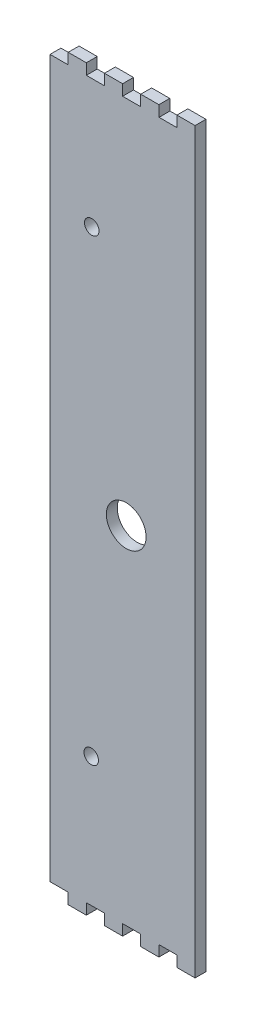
ISO-10303-21;
HEADER;
FILE_DESCRIPTION(('STEP AP214'),'2;1');
FILE_NAME('part.step','',(''),(''),'','','');
FILE_SCHEMA(('AUTOMOTIVE_DESIGN { 1 0 10303 214 1 1 1 1 }'));
ENDSEC;
DATA;
#1=APPLICATION_CONTEXT('core data for automotive mechanical design processes');
#2=APPLICATION_PROTOCOL_DEFINITION('international standard','automotive_design',2000,#1);
#3=PRODUCT_CONTEXT('',#1,'mechanical');
#4=PRODUCT('Part','Part','',(#3));
#5=PRODUCT_RELATED_PRODUCT_CATEGORY('part','',(#4));
#6=PRODUCT_DEFINITION_FORMATION('','',#4);
#7=PRODUCT_DEFINITION_CONTEXT('part definition',#1,'design');
#8=PRODUCT_DEFINITION('design','',#6,#7);
#9=PRODUCT_DEFINITION_SHAPE('','',#8);
#10=(LENGTH_UNIT() NAMED_UNIT(*) SI_UNIT(.MILLI.,.METRE.));
#11=(NAMED_UNIT(*) PLANE_ANGLE_UNIT() SI_UNIT($,.RADIAN.));
#12=(NAMED_UNIT(*) SI_UNIT($,.STERADIAN.) SOLID_ANGLE_UNIT());
#13=UNCERTAINTY_MEASURE_WITH_UNIT(LENGTH_MEASURE(1.E-05),#10,'distance_accuracy_value','');
#14=(GEOMETRIC_REPRESENTATION_CONTEXT(3) GLOBAL_UNCERTAINTY_ASSIGNED_CONTEXT((#13)) GLOBAL_UNIT_ASSIGNED_CONTEXT((#10,
#11,#12)) REPRESENTATION_CONTEXT('',''));
#15=CARTESIAN_POINT('',(0.,0.,0.));
#16=DIRECTION('',(0.,0.,1.));
#17=DIRECTION('',(1.,0.,0.));
#18=AXIS2_PLACEMENT_3D('',#15,#16,#17);
#19=CARTESIAN_POINT('',(-29.9999999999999,110.,6.));
#20=DIRECTION('',(0.,-1.,0.));
#21=DIRECTION('',(1.,0.,0.));
#22=AXIS2_PLACEMENT_3D('',#19,#20,#21);
#23=PLANE('',#22);
#24=DIRECTION('',(-1.,0.,0.));
#25=VECTOR('',#24,1.);
#26=CARTESIAN_POINT('',(-29.9999999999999,110.,0.));
#27=LINE('',#26,#25);
#28=CARTESIAN_POINT('',(-29.9999999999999,110.,0.));
#29=VERTEX_POINT('',#28);
#30=CARTESIAN_POINT('',(-39.9999999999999,110.,0.));
#31=VERTEX_POINT('',#30);
#32=EDGE_CURVE('E274',#29,#31,#27,.T.);
#33=ORIENTED_EDGE('',*,*,#32,.T.);
#34=DIRECTION('',(0.,0.,-1.));
#35=VECTOR('',#34,1.);
#36=CARTESIAN_POINT('',(-39.9999999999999,110.,6.));
#37=LINE('',#36,#35);
#38=CARTESIAN_POINT('',(-39.9999999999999,110.,6.));
#39=VERTEX_POINT('',#38);
#40=EDGE_CURVE('E11',#39,#31,#37,.T.);
#41=ORIENTED_EDGE('',*,*,#40,.F.);
#42=DIRECTION('',(-1.,0.,0.));
#43=VECTOR('',#42,1.);
#44=CARTESIAN_POINT('',(-29.9999999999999,110.,6.));
#45=LINE('',#44,#43);
#46=CARTESIAN_POINT('',(-29.9999999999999,110.,6.));
#47=VERTEX_POINT('',#46);
#48=EDGE_CURVE('E337',#47,#39,#45,.T.);
#49=ORIENTED_EDGE('',*,*,#48,.F.);
#50=DIRECTION('',(0.,0.,-1.));
#51=VECTOR('',#50,1.);
#52=CARTESIAN_POINT('',(-29.9999999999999,110.,6.));
#53=LINE('',#52,#51);
#54=EDGE_CURVE('E270',#47,#29,#53,.T.);
#55=ORIENTED_EDGE('',*,*,#54,.T.);
#56=EDGE_LOOP('',(#33,#41,#49,#55));
#57=FACE_BOUND('',#56,.T.);
#58=ADVANCED_FACE('F33',(#57),#23,.F.);
#59=CARTESIAN_POINT('',(-39.9999999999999,110.,6.));
#60=DIRECTION('',(1.,0.,0.));
#61=DIRECTION('',(0.,1.,0.));
#62=AXIS2_PLACEMENT_3D('',#59,#60,#61);
#63=PLANE('',#62);
#64=DIRECTION('',(0.,-1.,0.));
#65=VECTOR('',#64,1.);
#66=CARTESIAN_POINT('',(-39.9999999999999,110.,0.));
#67=LINE('',#66,#65);
#68=CARTESIAN_POINT('',(-39.9999999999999,-285.,0.));
#69=VERTEX_POINT('',#68);
#70=EDGE_CURVE('E277',#31,#69,#67,.T.);
#71=ORIENTED_EDGE('',*,*,#70,.T.);
#72=DIRECTION('',(0.,0.,-1.));
#73=VECTOR('',#72,1.);
#74=CARTESIAN_POINT('',(-39.9999999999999,-285.,6.));
#75=LINE('',#74,#73);
#76=CARTESIAN_POINT('',(-39.9999999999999,-285.,6.));
#77=VERTEX_POINT('',#76);
#78=EDGE_CURVE('E42',#77,#69,#75,.T.);
#79=ORIENTED_EDGE('',*,*,#78,.F.);
#80=DIRECTION('',(0.,-1.,0.));
#81=VECTOR('',#80,1.);
#82=CARTESIAN_POINT('',(-39.9999999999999,110.,6.));
#83=LINE('',#82,#81);
#84=EDGE_CURVE('E165',#39,#77,#83,.T.);
#85=ORIENTED_EDGE('',*,*,#84,.F.);
#86=ORIENTED_EDGE('',*,*,#40,.T.);
#87=EDGE_LOOP('',(#71,#79,#85,#86));
#88=FACE_BOUND('',#87,.T.);
#89=ADVANCED_FACE('F517',(#88),#63,.F.);
#90=CARTESIAN_POINT('',(-29.9999999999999,-285.,6.));
#91=DIRECTION('',(0.,1.,0.));
#92=DIRECTION('',(0.,0.,1.));
#93=AXIS2_PLACEMENT_3D('',#90,#91,#92);
#94=PLANE('',#93);
#95=DIRECTION('',(1.,0.,0.));
#96=VECTOR('',#95,1.);
#97=CARTESIAN_POINT('',(-29.9999999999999,-285.,0.));
#98=LINE('',#97,#96);
#99=CARTESIAN_POINT('',(-29.9999999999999,-285.,0.));
#100=VERTEX_POINT('',#99);
#101=EDGE_CURVE('E280',#69,#100,#98,.T.);
#102=ORIENTED_EDGE('',*,*,#101,.T.);
#103=DIRECTION('',(0.,0.,-1.));
#104=VECTOR('',#103,1.);
#105=CARTESIAN_POINT('',(-29.9999999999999,-285.,6.));
#106=LINE('',#105,#104);
#107=CARTESIAN_POINT('',(-29.9999999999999,-285.,6.));
#108=VERTEX_POINT('',#107);
#109=EDGE_CURVE('E416',#108,#100,#106,.T.);
#110=ORIENTED_EDGE('',*,*,#109,.F.);
#111=DIRECTION('',(1.,0.,0.));
#112=VECTOR('',#111,1.);
#113=CARTESIAN_POINT('',(-29.9999999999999,-285.,6.));
#114=LINE('',#113,#112);
#115=EDGE_CURVE('E425',#77,#108,#114,.T.);
#116=ORIENTED_EDGE('',*,*,#115,.F.);
#117=ORIENTED_EDGE('',*,*,#78,.T.);
#118=EDGE_LOOP('',(#102,#110,#116,#117));
#119=FACE_BOUND('',#118,.T.);
#120=ADVANCED_FACE('F423',(#119),#94,.F.);
#121=CARTESIAN_POINT('',(-29.9999999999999,-291.,6.));
#122=DIRECTION('',(1.,0.,0.));
#123=DIRECTION('',(0.,0.,-1.));
#124=AXIS2_PLACEMENT_3D('',#121,#122,#123);
#125=PLANE('',#124);
#126=DIRECTION('',(0.,-1.,0.));
#127=VECTOR('',#126,1.);
#128=CARTESIAN_POINT('',(-29.9999999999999,-291.,0.));
#129=LINE('',#128,#127);
#130=CARTESIAN_POINT('',(-29.9999999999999,-291.,0.));
#131=VERTEX_POINT('',#130);
#132=EDGE_CURVE('E282',#100,#131,#129,.T.);
#133=ORIENTED_EDGE('',*,*,#132,.T.);
#134=DIRECTION('',(0.,0.,-1.));
#135=VECTOR('',#134,1.);
#136=CARTESIAN_POINT('',(-29.9999999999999,-291.,6.));
#137=LINE('',#136,#135);
#138=CARTESIAN_POINT('',(-29.9999999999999,-291.,6.));
#139=VERTEX_POINT('',#138);
#140=EDGE_CURVE('E413',#139,#131,#137,.T.);
#141=ORIENTED_EDGE('',*,*,#140,.F.);
#142=DIRECTION('',(0.,-1.,0.));
#143=VECTOR('',#142,1.);
#144=CARTESIAN_POINT('',(-29.9999999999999,-291.,6.));
#145=LINE('',#144,#143);
#146=EDGE_CURVE('E443',#108,#139,#145,.T.);
#147=ORIENTED_EDGE('',*,*,#146,.F.);
#148=ORIENTED_EDGE('',*,*,#109,.T.);
#149=EDGE_LOOP('',(#133,#141,#147,#148));
#150=FACE_BOUND('',#149,.T.);
#151=ADVANCED_FACE('F434',(#150),#125,.F.);
#152=CARTESIAN_POINT('',(-19.9999999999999,-291.,6.));
#153=DIRECTION('',(0.,1.,0.));
#154=DIRECTION('',(0.,0.,1.));
#155=AXIS2_PLACEMENT_3D('',#152,#153,#154);
#156=PLANE('',#155);
#157=DIRECTION('',(1.,0.,0.));
#158=VECTOR('',#157,1.);
#159=CARTESIAN_POINT('',(-19.9999999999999,-291.,0.));
#160=LINE('',#159,#158);
#161=CARTESIAN_POINT('',(-19.9999999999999,-291.,0.));
#162=VERTEX_POINT('',#161);
#163=EDGE_CURVE('E284',#131,#162,#160,.T.);
#164=ORIENTED_EDGE('',*,*,#163,.T.);
#165=DIRECTION('',(0.,0.,-1.));
#166=VECTOR('',#165,1.);
#167=CARTESIAN_POINT('',(-19.9999999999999,-291.,6.));
#168=LINE('',#167,#166);
#169=CARTESIAN_POINT('',(-19.9999999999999,-291.,6.));
#170=VERTEX_POINT('',#169);
#171=EDGE_CURVE('E410',#170,#162,#168,.T.);
#172=ORIENTED_EDGE('',*,*,#171,.F.);
#173=DIRECTION('',(1.,0.,0.));
#174=VECTOR('',#173,1.);
#175=CARTESIAN_POINT('',(-19.9999999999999,-291.,6.));
#176=LINE('',#175,#174);
#177=EDGE_CURVE('E440',#139,#170,#176,.T.);
#178=ORIENTED_EDGE('',*,*,#177,.F.);
#179=ORIENTED_EDGE('',*,*,#140,.T.);
#180=EDGE_LOOP('',(#164,#172,#178,#179));
#181=FACE_BOUND('',#180,.T.);
#182=ADVANCED_FACE('F438',(#181),#156,.F.);
#183=CARTESIAN_POINT('',(-19.9999999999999,-291.,6.));
#184=DIRECTION('',(-1.,0.,0.));
#185=DIRECTION('',(0.,0.,1.));
#186=AXIS2_PLACEMENT_3D('',#183,#184,#185);
#187=PLANE('',#186);
#188=DIRECTION('',(0.,1.,0.));
#189=VECTOR('',#188,1.);
#190=CARTESIAN_POINT('',(-19.9999999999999,-291.,0.));
#191=LINE('',#190,#189);
#192=CARTESIAN_POINT('',(-19.9999999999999,-285.,0.));
#193=VERTEX_POINT('',#192);
#194=EDGE_CURVE('E286',#162,#193,#191,.T.);
#195=ORIENTED_EDGE('',*,*,#194,.T.);
#196=DIRECTION('',(0.,0.,-1.));
#197=VECTOR('',#196,1.);
#198=CARTESIAN_POINT('',(-19.9999999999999,-285.,6.));
#199=LINE('',#198,#197);
#200=CARTESIAN_POINT('',(-19.9999999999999,-285.,6.));
#201=VERTEX_POINT('',#200);
#202=EDGE_CURVE('E407',#201,#193,#199,.T.);
#203=ORIENTED_EDGE('',*,*,#202,.F.);
#204=DIRECTION('',(0.,1.,0.));
#205=VECTOR('',#204,1.);
#206=CARTESIAN_POINT('',(-19.9999999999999,-291.,6.));
#207=LINE('',#206,#205);
#208=EDGE_CURVE('E442',#170,#201,#207,.T.);
#209=ORIENTED_EDGE('',*,*,#208,.F.);
#210=ORIENTED_EDGE('',*,*,#171,.T.);
#211=EDGE_LOOP('',(#195,#203,#209,#210));
#212=FACE_BOUND('',#211,.T.);
#213=ADVANCED_FACE('F530',(#212),#187,.F.);
#214=CARTESIAN_POINT('',(-9.9999999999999,-285.,6.));
#215=DIRECTION('',(0.,1.,0.));
#216=DIRECTION('',(0.,0.,1.));
#217=AXIS2_PLACEMENT_3D('',#214,#215,#216);
#218=PLANE('',#217);
#219=DIRECTION('',(1.,0.,0.));
#220=VECTOR('',#219,1.);
#221=CARTESIAN_POINT('',(-9.9999999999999,-285.,0.));
#222=LINE('',#221,#220);
#223=CARTESIAN_POINT('',(-9.9999999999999,-285.,0.));
#224=VERTEX_POINT('',#223);
#225=EDGE_CURVE('E288',#193,#224,#222,.T.);
#226=ORIENTED_EDGE('',*,*,#225,.T.);
#227=DIRECTION('',(0.,0.,-1.));
#228=VECTOR('',#227,1.);
#229=CARTESIAN_POINT('',(-9.9999999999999,-285.,6.));
#230=LINE('',#229,#228);
#231=CARTESIAN_POINT('',(-9.9999999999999,-285.,6.));
#232=VERTEX_POINT('',#231);
#233=EDGE_CURVE('E404',#232,#224,#230,.T.);
#234=ORIENTED_EDGE('',*,*,#233,.F.);
#235=DIRECTION('',(1.,0.,0.));
#236=VECTOR('',#235,1.);
#237=CARTESIAN_POINT('',(-9.9999999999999,-285.,6.));
#238=LINE('',#237,#236);
#239=EDGE_CURVE('E445',#201,#232,#238,.T.);
#240=ORIENTED_EDGE('',*,*,#239,.F.);
#241=ORIENTED_EDGE('',*,*,#202,.T.);
#242=EDGE_LOOP('',(#226,#234,#240,#241));
#243=FACE_BOUND('',#242,.T.);
#244=ADVANCED_FACE('F533',(#243),#218,.F.);
#245=CARTESIAN_POINT('',(-9.9999999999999,-291.,6.));
#246=DIRECTION('',(1.,0.,0.));
#247=DIRECTION('',(0.,0.,-1.));
#248=AXIS2_PLACEMENT_3D('',#245,#246,#247);
#249=PLANE('',#248);
#250=DIRECTION('',(0.,-1.,0.));
#251=VECTOR('',#250,1.);
#252=CARTESIAN_POINT('',(-9.9999999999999,-291.,0.));
#253=LINE('',#252,#251);
#254=CARTESIAN_POINT('',(-9.9999999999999,-291.,0.));
#255=VERTEX_POINT('',#254);
#256=EDGE_CURVE('E290',#224,#255,#253,.T.);
#257=ORIENTED_EDGE('',*,*,#256,.T.);
#258=DIRECTION('',(0.,0.,-1.));
#259=VECTOR('',#258,1.);
#260=CARTESIAN_POINT('',(-9.9999999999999,-291.,6.));
#261=LINE('',#260,#259);
#262=CARTESIAN_POINT('',(-9.9999999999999,-291.,6.));
#263=VERTEX_POINT('',#262);
#264=EDGE_CURVE('E401',#263,#255,#261,.T.);
#265=ORIENTED_EDGE('',*,*,#264,.F.);
#266=DIRECTION('',(0.,-1.,0.));
#267=VECTOR('',#266,1.);
#268=CARTESIAN_POINT('',(-9.9999999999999,-291.,6.));
#269=LINE('',#268,#267);
#270=EDGE_CURVE('E451',#232,#263,#269,.T.);
#271=ORIENTED_EDGE('',*,*,#270,.F.);
#272=ORIENTED_EDGE('',*,*,#233,.T.);
#273=EDGE_LOOP('',(#257,#265,#271,#272));
#274=FACE_BOUND('',#273,.T.);
#275=ADVANCED_FACE('F537',(#274),#249,.F.);
#276=CARTESIAN_POINT('',(1.04083408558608E-13,-291.,6.));
#277=DIRECTION('',(0.,1.,0.));
#278=DIRECTION('',(0.,0.,1.));
#279=AXIS2_PLACEMENT_3D('',#276,#277,#278);
#280=PLANE('',#279);
#281=DIRECTION('',(1.,0.,0.));
#282=VECTOR('',#281,1.);
#283=CARTESIAN_POINT('',(1.04083408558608E-13,-291.,0.));
#284=LINE('',#283,#282);
#285=CARTESIAN_POINT('',(1.04083408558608E-13,-291.,0.));
#286=VERTEX_POINT('',#285);
#287=EDGE_CURVE('E292',#255,#286,#284,.T.);
#288=ORIENTED_EDGE('',*,*,#287,.T.);
#289=DIRECTION('',(0.,0.,-1.));
#290=VECTOR('',#289,1.);
#291=CARTESIAN_POINT('',(1.04083408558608E-13,-291.,6.));
#292=LINE('',#291,#290);
#293=CARTESIAN_POINT('',(1.04083408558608E-13,-291.,6.));
#294=VERTEX_POINT('',#293);
#295=EDGE_CURVE('E398',#294,#286,#292,.T.);
#296=ORIENTED_EDGE('',*,*,#295,.F.);
#297=DIRECTION('',(1.,0.,0.));
#298=VECTOR('',#297,1.);
#299=CARTESIAN_POINT('',(1.04083408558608E-13,-291.,6.));
#300=LINE('',#299,#298);
#301=EDGE_CURVE('E453',#263,#294,#300,.T.);
#302=ORIENTED_EDGE('',*,*,#301,.F.);
#303=ORIENTED_EDGE('',*,*,#264,.T.);
#304=EDGE_LOOP('',(#288,#296,#302,#303));
#305=FACE_BOUND('',#304,.T.);
#306=ADVANCED_FACE('F541',(#305),#280,.F.);
#307=CARTESIAN_POINT('',(1.04083408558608E-13,-291.,6.));
#308=DIRECTION('',(-1.,0.,0.));
#309=DIRECTION('',(0.,0.,1.));
#310=AXIS2_PLACEMENT_3D('',#307,#308,#309);
#311=PLANE('',#310);
#312=DIRECTION('',(0.,1.,0.));
#313=VECTOR('',#312,1.);
#314=CARTESIAN_POINT('',(1.04083408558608E-13,-291.,0.));
#315=LINE('',#314,#313);
#316=CARTESIAN_POINT('',(1.04083408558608E-13,-285.,0.));
#317=VERTEX_POINT('',#316);
#318=EDGE_CURVE('E294',#286,#317,#315,.T.);
#319=ORIENTED_EDGE('',*,*,#318,.T.);
#320=DIRECTION('',(0.,0.,-1.));
#321=VECTOR('',#320,1.);
#322=CARTESIAN_POINT('',(1.04083408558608E-13,-285.,6.));
#323=LINE('',#322,#321);
#324=CARTESIAN_POINT('',(1.04083408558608E-13,-285.,6.));
#325=VERTEX_POINT('',#324);
#326=EDGE_CURVE('E395',#325,#317,#323,.T.);
#327=ORIENTED_EDGE('',*,*,#326,.F.);
#328=DIRECTION('',(0.,1.,0.));
#329=VECTOR('',#328,1.);
#330=CARTESIAN_POINT('',(1.04083408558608E-13,-291.,6.));
#331=LINE('',#330,#329);
#332=EDGE_CURVE('E455',#294,#325,#331,.T.);
#333=ORIENTED_EDGE('',*,*,#332,.F.);
#334=ORIENTED_EDGE('',*,*,#295,.T.);
#335=EDGE_LOOP('',(#319,#327,#333,#334));
#336=FACE_BOUND('',#335,.T.);
#337=ADVANCED_FACE('F545',(#336),#311,.F.);
#338=CARTESIAN_POINT('',(10.0000000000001,-285.,6.));
#339=DIRECTION('',(0.,1.,0.));
#340=DIRECTION('',(0.,0.,1.));
#341=AXIS2_PLACEMENT_3D('',#338,#339,#340);
#342=PLANE('',#341);
#343=DIRECTION('',(1.,0.,0.));
#344=VECTOR('',#343,1.);
#345=CARTESIAN_POINT('',(10.0000000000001,-285.,0.));
#346=LINE('',#345,#344);
#347=CARTESIAN_POINT('',(10.0000000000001,-285.,0.));
#348=VERTEX_POINT('',#347);
#349=EDGE_CURVE('E296',#317,#348,#346,.T.);
#350=ORIENTED_EDGE('',*,*,#349,.T.);
#351=DIRECTION('',(0.,0.,-1.));
#352=VECTOR('',#351,1.);
#353=CARTESIAN_POINT('',(10.0000000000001,-285.,6.));
#354=LINE('',#353,#352);
#355=CARTESIAN_POINT('',(10.0000000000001,-285.,6.));
#356=VERTEX_POINT('',#355);
#357=EDGE_CURVE('E392',#356,#348,#354,.T.);
#358=ORIENTED_EDGE('',*,*,#357,.F.);
#359=DIRECTION('',(1.,0.,0.));
#360=VECTOR('',#359,1.);
#361=CARTESIAN_POINT('',(10.0000000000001,-285.,6.));
#362=LINE('',#361,#360);
#363=EDGE_CURVE('E457',#325,#356,#362,.T.);
#364=ORIENTED_EDGE('',*,*,#363,.F.);
#365=ORIENTED_EDGE('',*,*,#326,.T.);
#366=EDGE_LOOP('',(#350,#358,#364,#365));
#367=FACE_BOUND('',#366,.T.);
#368=ADVANCED_FACE('F549',(#367),#342,.F.);
#369=CARTESIAN_POINT('',(10.0000000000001,-291.,6.));
#370=DIRECTION('',(1.,0.,0.));
#371=DIRECTION('',(0.,0.,-1.));
#372=AXIS2_PLACEMENT_3D('',#369,#370,#371);
#373=PLANE('',#372);
#374=DIRECTION('',(0.,-1.,0.));
#375=VECTOR('',#374,1.);
#376=CARTESIAN_POINT('',(10.0000000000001,-291.,0.));
#377=LINE('',#376,#375);
#378=CARTESIAN_POINT('',(10.0000000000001,-291.,0.));
#379=VERTEX_POINT('',#378);
#380=EDGE_CURVE('E298',#348,#379,#377,.T.);
#381=ORIENTED_EDGE('',*,*,#380,.T.);
#382=DIRECTION('',(0.,0.,-1.));
#383=VECTOR('',#382,1.);
#384=CARTESIAN_POINT('',(10.0000000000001,-291.,6.));
#385=LINE('',#384,#383);
#386=CARTESIAN_POINT('',(10.0000000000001,-291.,6.));
#387=VERTEX_POINT('',#386);
#388=EDGE_CURVE('E389',#387,#379,#385,.T.);
#389=ORIENTED_EDGE('',*,*,#388,.F.);
#390=DIRECTION('',(0.,-1.,0.));
#391=VECTOR('',#390,1.);
#392=CARTESIAN_POINT('',(10.0000000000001,-291.,6.));
#393=LINE('',#392,#391);
#394=EDGE_CURVE('E459',#356,#387,#393,.T.);
#395=ORIENTED_EDGE('',*,*,#394,.F.);
#396=ORIENTED_EDGE('',*,*,#357,.T.);
#397=EDGE_LOOP('',(#381,#389,#395,#396));
#398=FACE_BOUND('',#397,.T.);
#399=ADVANCED_FACE('F553',(#398),#373,.F.);
#400=CARTESIAN_POINT('',(20.0000000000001,-291.,6.));
#401=DIRECTION('',(0.,1.,0.));
#402=DIRECTION('',(0.,0.,1.));
#403=AXIS2_PLACEMENT_3D('',#400,#401,#402);
#404=PLANE('',#403);
#405=DIRECTION('',(1.,0.,0.));
#406=VECTOR('',#405,1.);
#407=CARTESIAN_POINT('',(20.0000000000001,-291.,0.));
#408=LINE('',#407,#406);
#409=CARTESIAN_POINT('',(20.0000000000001,-291.,0.));
#410=VERTEX_POINT('',#409);
#411=EDGE_CURVE('E300',#379,#410,#408,.T.);
#412=ORIENTED_EDGE('',*,*,#411,.T.);
#413=DIRECTION('',(0.,0.,-1.));
#414=VECTOR('',#413,1.);
#415=CARTESIAN_POINT('',(20.0000000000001,-291.,6.));
#416=LINE('',#415,#414);
#417=CARTESIAN_POINT('',(20.0000000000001,-291.,6.));
#418=VERTEX_POINT('',#417);
#419=EDGE_CURVE('E386',#418,#410,#416,.T.);
#420=ORIENTED_EDGE('',*,*,#419,.F.);
#421=DIRECTION('',(1.,0.,0.));
#422=VECTOR('',#421,1.);
#423=CARTESIAN_POINT('',(20.0000000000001,-291.,6.));
#424=LINE('',#423,#422);
#425=EDGE_CURVE('E461',#387,#418,#424,.T.);
#426=ORIENTED_EDGE('',*,*,#425,.F.);
#427=ORIENTED_EDGE('',*,*,#388,.T.);
#428=EDGE_LOOP('',(#412,#420,#426,#427));
#429=FACE_BOUND('',#428,.T.);
#430=ADVANCED_FACE('F557',(#429),#404,.F.);
#431=CARTESIAN_POINT('',(20.0000000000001,-291.,6.));
#432=DIRECTION('',(-1.,0.,0.));
#433=DIRECTION('',(0.,-1.,0.));
#434=AXIS2_PLACEMENT_3D('',#431,#432,#433);
#435=PLANE('',#434);
#436=DIRECTION('',(0.,1.,0.));
#437=VECTOR('',#436,1.);
#438=CARTESIAN_POINT('',(20.0000000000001,-291.,0.));
#439=LINE('',#438,#437);
#440=CARTESIAN_POINT('',(20.0000000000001,-285.,0.));
#441=VERTEX_POINT('',#440);
#442=EDGE_CURVE('E302',#410,#441,#439,.T.);
#443=ORIENTED_EDGE('',*,*,#442,.T.);
#444=DIRECTION('',(0.,0.,-1.));
#445=VECTOR('',#444,1.);
#446=CARTESIAN_POINT('',(20.0000000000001,-285.,6.));
#447=LINE('',#446,#445);
#448=CARTESIAN_POINT('',(20.0000000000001,-285.,6.));
#449=VERTEX_POINT('',#448);
#450=EDGE_CURVE('E383',#449,#441,#447,.T.);
#451=ORIENTED_EDGE('',*,*,#450,.F.);
#452=DIRECTION('',(0.,1.,0.));
#453=VECTOR('',#452,1.);
#454=CARTESIAN_POINT('',(20.0000000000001,-291.,6.));
#455=LINE('',#454,#453);
#456=EDGE_CURVE('E463',#418,#449,#455,.T.);
#457=ORIENTED_EDGE('',*,*,#456,.F.);
#458=ORIENTED_EDGE('',*,*,#419,.T.);
#459=EDGE_LOOP('',(#443,#451,#457,#458));
#460=FACE_BOUND('',#459,.T.);
#461=ADVANCED_FACE('F561',(#460),#435,.F.);
#462=CARTESIAN_POINT('',(30.0000000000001,-285.,6.));
#463=DIRECTION('',(0.,1.,0.));
#464=DIRECTION('',(0.,0.,1.));
#465=AXIS2_PLACEMENT_3D('',#462,#463,#464);
#466=PLANE('',#465);
#467=DIRECTION('',(1.,0.,0.));
#468=VECTOR('',#467,1.);
#469=CARTESIAN_POINT('',(30.0000000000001,-285.,0.));
#470=LINE('',#469,#468);
#471=CARTESIAN_POINT('',(30.0000000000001,-285.,0.));
#472=VERTEX_POINT('',#471);
#473=EDGE_CURVE('E304',#441,#472,#470,.T.);
#474=ORIENTED_EDGE('',*,*,#473,.T.);
#475=DIRECTION('',(0.,0.,-1.));
#476=VECTOR('',#475,1.);
#477=CARTESIAN_POINT('',(30.0000000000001,-285.,6.));
#478=LINE('',#477,#476);
#479=CARTESIAN_POINT('',(30.0000000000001,-285.,6.));
#480=VERTEX_POINT('',#479);
#481=EDGE_CURVE('E380',#480,#472,#478,.T.);
#482=ORIENTED_EDGE('',*,*,#481,.F.);
#483=DIRECTION('',(1.,0.,0.));
#484=VECTOR('',#483,1.);
#485=CARTESIAN_POINT('',(30.0000000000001,-285.,6.));
#486=LINE('',#485,#484);
#487=EDGE_CURVE('E465',#449,#480,#486,.T.);
#488=ORIENTED_EDGE('',*,*,#487,.F.);
#489=ORIENTED_EDGE('',*,*,#450,.T.);
#490=EDGE_LOOP('',(#474,#482,#488,#489));
#491=FACE_BOUND('',#490,.T.);
#492=ADVANCED_FACE('F565',(#491),#466,.F.);
#493=CARTESIAN_POINT('',(29.95,-291.,6.));
#494=DIRECTION('',(0.999965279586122,-0.00833304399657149,0.));
#495=DIRECTION('',(0.00833304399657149,0.999965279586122,0.));
#496=AXIS2_PLACEMENT_3D('',#493,#494,#495);
#497=PLANE('',#496);
#498=DIRECTION('',(-0.00833304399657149,-0.999965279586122,0.));
#499=VECTOR('',#498,1.);
#500=CARTESIAN_POINT('',(29.95,-291.,0.));
#501=LINE('',#500,#499);
#502=CARTESIAN_POINT('',(29.95,-291.,0.));
#503=VERTEX_POINT('',#502);
#504=EDGE_CURVE('E306',#472,#503,#501,.T.);
#505=ORIENTED_EDGE('',*,*,#504,.T.);
#506=DIRECTION('',(0.,0.,-1.));
#507=VECTOR('',#506,1.);
#508=CARTESIAN_POINT('',(29.95,-291.,6.));
#509=LINE('',#508,#507);
#510=CARTESIAN_POINT('',(29.95,-291.,6.));
#511=VERTEX_POINT('',#510);
#512=EDGE_CURVE('E377',#511,#503,#509,.T.);
#513=ORIENTED_EDGE('',*,*,#512,.F.);
#514=DIRECTION('',(-0.00833304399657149,-0.999965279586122,0.));
#515=VECTOR('',#514,1.);
#516=CARTESIAN_POINT('',(29.95,-291.,6.));
#517=LINE('',#516,#515);
#518=EDGE_CURVE('E467',#480,#511,#517,.T.);
#519=ORIENTED_EDGE('',*,*,#518,.F.);
#520=ORIENTED_EDGE('',*,*,#481,.T.);
#521=EDGE_LOOP('',(#505,#513,#519,#520));
#522=FACE_BOUND('',#521,.T.);
#523=ADVANCED_FACE('F569',(#522),#497,.F.);
#524=CARTESIAN_POINT('',(39.95,-291.,6.));
#525=DIRECTION('',(0.,1.,0.));
#526=DIRECTION('',(0.,0.,1.));
#527=AXIS2_PLACEMENT_3D('',#524,#525,#526);
#528=PLANE('',#527);
#529=DIRECTION('',(1.,0.,0.));
#530=VECTOR('',#529,1.);
#531=CARTESIAN_POINT('',(39.95,-291.,0.));
#532=LINE('',#531,#530);
#533=CARTESIAN_POINT('',(39.95,-291.,0.));
#534=VERTEX_POINT('',#533);
#535=EDGE_CURVE('E308',#503,#534,#532,.T.);
#536=ORIENTED_EDGE('',*,*,#535,.T.);
#537=DIRECTION('',(0.,0.,-1.));
#538=VECTOR('',#537,1.);
#539=CARTESIAN_POINT('',(39.95,-291.,6.));
#540=LINE('',#539,#538);
#541=CARTESIAN_POINT('',(39.95,-291.,6.));
#542=VERTEX_POINT('',#541);
#543=EDGE_CURVE('E374',#542,#534,#540,.T.);
#544=ORIENTED_EDGE('',*,*,#543,.F.);
#545=DIRECTION('',(1.,0.,0.));
#546=VECTOR('',#545,1.);
#547=CARTESIAN_POINT('',(39.95,-291.,6.));
#548=LINE('',#547,#546);
#549=EDGE_CURVE('E469',#511,#542,#548,.T.);
#550=ORIENTED_EDGE('',*,*,#549,.F.);
#551=ORIENTED_EDGE('',*,*,#512,.T.);
#552=EDGE_LOOP('',(#536,#544,#550,#551));
#553=FACE_BOUND('',#552,.T.);
#554=ADVANCED_FACE('F573',(#553),#528,.F.);
#555=CARTESIAN_POINT('',(39.95,116.,6.));
#556=DIRECTION('',(-1.,0.,0.));
#557=DIRECTION('',(0.,0.,1.));
#558=AXIS2_PLACEMENT_3D('',#555,#556,#557);
#559=PLANE('',#558);
#560=DIRECTION('',(0.,1.,0.));
#561=VECTOR('',#560,1.);
#562=CARTESIAN_POINT('',(39.95,116.,0.));
#563=LINE('',#562,#561);
#564=CARTESIAN_POINT('',(39.95,116.,0.));
#565=VERTEX_POINT('',#564);
#566=EDGE_CURVE('E310',#534,#565,#563,.T.);
#567=ORIENTED_EDGE('',*,*,#566,.T.);
#568=DIRECTION('',(0.,0.,-1.));
#569=VECTOR('',#568,1.);
#570=CARTESIAN_POINT('',(39.95,116.,6.));
#571=LINE('',#570,#569);
#572=CARTESIAN_POINT('',(39.95,116.,6.));
#573=VERTEX_POINT('',#572);
#574=EDGE_CURVE('E371',#573,#565,#571,.T.);
#575=ORIENTED_EDGE('',*,*,#574,.F.);
#576=DIRECTION('',(0.,1.,0.));
#577=VECTOR('',#576,1.);
#578=CARTESIAN_POINT('',(39.95,116.,6.));
#579=LINE('',#578,#577);
#580=EDGE_CURVE('E471',#542,#573,#579,.T.);
#581=ORIENTED_EDGE('',*,*,#580,.F.);
#582=ORIENTED_EDGE('',*,*,#543,.T.);
#583=EDGE_LOOP('',(#567,#575,#581,#582));
#584=FACE_BOUND('',#583,.T.);
#585=ADVANCED_FACE('F577',(#584),#559,.F.);
#586=CARTESIAN_POINT('',(39.95,116.,6.));
#587=DIRECTION('',(0.,-1.,0.));
#588=DIRECTION('',(0.,0.,-1.));
#589=AXIS2_PLACEMENT_3D('',#586,#587,#588);
#590=PLANE('',#589);
#591=DIRECTION('',(-1.,0.,0.));
#592=VECTOR('',#591,1.);
#593=CARTESIAN_POINT('',(39.95,116.,0.));
#594=LINE('',#593,#592);
#595=CARTESIAN_POINT('',(29.95,116.,0.));
#596=VERTEX_POINT('',#595);
#597=EDGE_CURVE('E312',#565,#596,#594,.T.);
#598=ORIENTED_EDGE('',*,*,#597,.T.);
#599=DIRECTION('',(0.,0.,-1.));
#600=VECTOR('',#599,1.);
#601=CARTESIAN_POINT('',(29.95,116.,6.));
#602=LINE('',#601,#600);
#603=CARTESIAN_POINT('',(29.95,116.,6.));
#604=VERTEX_POINT('',#603);
#605=EDGE_CURVE('E368',#604,#596,#602,.T.);
#606=ORIENTED_EDGE('',*,*,#605,.F.);
#607=DIRECTION('',(-1.,0.,0.));
#608=VECTOR('',#607,1.);
#609=CARTESIAN_POINT('',(39.95,116.,6.));
#610=LINE('',#609,#608);
#611=EDGE_CURVE('E473',#573,#604,#610,.T.);
#612=ORIENTED_EDGE('',*,*,#611,.F.);
#613=ORIENTED_EDGE('',*,*,#574,.T.);
#614=EDGE_LOOP('',(#598,#606,#612,#613));
#615=FACE_BOUND('',#614,.T.);
#616=ADVANCED_FACE('F581',(#615),#590,.F.);
#617=CARTESIAN_POINT('',(29.95,116.,6.));
#618=DIRECTION('',(0.999687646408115,0.0249921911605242,0.));
#619=DIRECTION('',(-0.0249921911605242,0.999687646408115,0.));
#620=AXIS2_PLACEMENT_3D('',#617,#618,#619);
#621=PLANE('',#620);
#622=DIRECTION('',(0.0249921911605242,-0.999687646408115,0.));
#623=VECTOR('',#622,1.);
#624=CARTESIAN_POINT('',(29.95,116.,0.));
#625=LINE('',#624,#623);
#626=CARTESIAN_POINT('',(30.1000000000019,110.,0.));
#627=VERTEX_POINT('',#626);
#628=EDGE_CURVE('E314',#596,#627,#625,.T.);
#629=ORIENTED_EDGE('',*,*,#628,.T.);
#630=DIRECTION('',(0.,0.,-1.));
#631=VECTOR('',#630,1.);
#632=CARTESIAN_POINT('',(30.1000000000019,110.,6.));
#633=LINE('',#632,#631);
#634=CARTESIAN_POINT('',(30.1000000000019,110.,6.));
#635=VERTEX_POINT('',#634);
#636=EDGE_CURVE('E365',#635,#627,#633,.T.);
#637=ORIENTED_EDGE('',*,*,#636,.F.);
#638=DIRECTION('',(0.0249921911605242,-0.999687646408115,0.));
#639=VECTOR('',#638,1.);
#640=CARTESIAN_POINT('',(29.95,116.,6.));
#641=LINE('',#640,#639);
#642=EDGE_CURVE('E475',#604,#635,#641,.T.);
#643=ORIENTED_EDGE('',*,*,#642,.F.);
#644=ORIENTED_EDGE('',*,*,#605,.T.);
#645=EDGE_LOOP('',(#629,#637,#643,#644));
#646=FACE_BOUND('',#645,.T.);
#647=ADVANCED_FACE('F585',(#646),#621,.F.);
#648=CARTESIAN_POINT('',(30.1000000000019,110.,6.));
#649=DIRECTION('',(0.,-1.,0.));
#650=DIRECTION('',(1.,0.,0.));
#651=AXIS2_PLACEMENT_3D('',#648,#649,#650);
#652=PLANE('',#651);
#653=DIRECTION('',(-1.,0.,0.));
#654=VECTOR('',#653,1.);
#655=CARTESIAN_POINT('',(30.1000000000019,110.,0.));
#656=LINE('',#655,#654);
#657=CARTESIAN_POINT('',(20.1000000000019,110.,0.));
#658=VERTEX_POINT('',#657);
#659=EDGE_CURVE('E316',#627,#658,#656,.T.);
#660=ORIENTED_EDGE('',*,*,#659,.T.);
#661=DIRECTION('',(0.,0.,-1.));
#662=VECTOR('',#661,1.);
#663=CARTESIAN_POINT('',(20.1000000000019,110.,6.));
#664=LINE('',#663,#662);
#665=CARTESIAN_POINT('',(20.1000000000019,110.,6.));
#666=VERTEX_POINT('',#665);
#667=EDGE_CURVE('E362',#666,#658,#664,.T.);
#668=ORIENTED_EDGE('',*,*,#667,.F.);
#669=DIRECTION('',(-1.,0.,0.));
#670=VECTOR('',#669,1.);
#671=CARTESIAN_POINT('',(30.1000000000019,110.,6.));
#672=LINE('',#671,#670);
#673=EDGE_CURVE('E477',#635,#666,#672,.T.);
#674=ORIENTED_EDGE('',*,*,#673,.F.);
#675=ORIENTED_EDGE('',*,*,#636,.T.);
#676=EDGE_LOOP('',(#660,#668,#674,#675));
#677=FACE_BOUND('',#676,.T.);
#678=ADVANCED_FACE('F589',(#677),#652,.F.);
#679=CARTESIAN_POINT('',(20.,116.,6.));
#680=DIRECTION('',(-0.999861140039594,-0.0166643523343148,0.));
#681=DIRECTION('',(0.0166643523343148,-0.999861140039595,0.));
#682=AXIS2_PLACEMENT_3D('',#679,#680,#681);
#683=PLANE('',#682);
#684=DIRECTION('',(-0.0166643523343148,0.999861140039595,0.));
#685=VECTOR('',#684,1.);
#686=CARTESIAN_POINT('',(20.,116.,0.));
#687=LINE('',#686,#685);
#688=CARTESIAN_POINT('',(20.,116.,0.));
#689=VERTEX_POINT('',#688);
#690=EDGE_CURVE('E318',#658,#689,#687,.T.);
#691=ORIENTED_EDGE('',*,*,#690,.T.);
#692=DIRECTION('',(0.,0.,-1.));
#693=VECTOR('',#692,1.);
#694=CARTESIAN_POINT('',(20.,116.,6.));
#695=LINE('',#694,#693);
#696=CARTESIAN_POINT('',(20.,116.,6.));
#697=VERTEX_POINT('',#696);
#698=EDGE_CURVE('E359',#697,#689,#695,.T.);
#699=ORIENTED_EDGE('',*,*,#698,.F.);
#700=DIRECTION('',(-0.0166643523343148,0.999861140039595,0.));
#701=VECTOR('',#700,1.);
#702=CARTESIAN_POINT('',(20.,116.,6.));
#703=LINE('',#702,#701);
#704=EDGE_CURVE('E479',#666,#697,#703,.T.);
#705=ORIENTED_EDGE('',*,*,#704,.F.);
#706=ORIENTED_EDGE('',*,*,#667,.T.);
#707=EDGE_LOOP('',(#691,#699,#705,#706));
#708=FACE_BOUND('',#707,.T.);
#709=ADVANCED_FACE('F593',(#708),#683,.F.);
#710=CARTESIAN_POINT('',(20.,116.,6.));
#711=DIRECTION('',(0.,-1.,0.));
#712=DIRECTION('',(0.,0.,-1.));
#713=AXIS2_PLACEMENT_3D('',#710,#711,#712);
#714=PLANE('',#713);
#715=DIRECTION('',(-1.,0.,0.));
#716=VECTOR('',#715,1.);
#717=CARTESIAN_POINT('',(20.,116.,0.));
#718=LINE('',#717,#716);
#719=CARTESIAN_POINT('',(9.99999999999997,116.,0.));
#720=VERTEX_POINT('',#719);
#721=EDGE_CURVE('E320',#689,#720,#718,.T.);
#722=ORIENTED_EDGE('',*,*,#721,.T.);
#723=DIRECTION('',(0.,0.,-1.));
#724=VECTOR('',#723,1.);
#725=CARTESIAN_POINT('',(9.99999999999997,116.,6.));
#726=LINE('',#725,#724);
#727=CARTESIAN_POINT('',(9.99999999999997,116.,6.));
#728=VERTEX_POINT('',#727);
#729=EDGE_CURVE('E356',#728,#720,#726,.T.);
#730=ORIENTED_EDGE('',*,*,#729,.F.);
#731=DIRECTION('',(-1.,0.,0.));
#732=VECTOR('',#731,1.);
#733=CARTESIAN_POINT('',(20.,116.,6.));
#734=LINE('',#733,#732);
#735=EDGE_CURVE('E481',#697,#728,#734,.T.);
#736=ORIENTED_EDGE('',*,*,#735,.F.);
#737=ORIENTED_EDGE('',*,*,#698,.T.);
#738=EDGE_LOOP('',(#722,#730,#736,#737));
#739=FACE_BOUND('',#738,.T.);
#740=ADVANCED_FACE('F597',(#739),#714,.F.);
#741=CARTESIAN_POINT('',(9.99999999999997,116.,6.));
#742=DIRECTION('',(1.,0.,0.));
#743=DIRECTION('',(0.,0.,-1.));
#744=AXIS2_PLACEMENT_3D('',#741,#742,#743);
#745=PLANE('',#744);
#746=DIRECTION('',(0.,-1.,0.));
#747=VECTOR('',#746,1.);
#748=CARTESIAN_POINT('',(9.99999999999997,116.,0.));
#749=LINE('',#748,#747);
#750=CARTESIAN_POINT('',(9.99999999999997,110.,0.));
#751=VERTEX_POINT('',#750);
#752=EDGE_CURVE('E322',#720,#751,#749,.T.);
#753=ORIENTED_EDGE('',*,*,#752,.T.);
#754=DIRECTION('',(0.,0.,-1.));
#755=VECTOR('',#754,1.);
#756=CARTESIAN_POINT('',(9.99999999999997,110.,6.));
#757=LINE('',#756,#755);
#758=CARTESIAN_POINT('',(9.99999999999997,110.,6.));
#759=VERTEX_POINT('',#758);
#760=EDGE_CURVE('E353',#759,#751,#757,.T.);
#761=ORIENTED_EDGE('',*,*,#760,.F.);
#762=DIRECTION('',(0.,-1.,0.));
#763=VECTOR('',#762,1.);
#764=CARTESIAN_POINT('',(9.99999999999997,116.,6.));
#765=LINE('',#764,#763);
#766=EDGE_CURVE('E483',#728,#759,#765,.T.);
#767=ORIENTED_EDGE('',*,*,#766,.F.);
#768=ORIENTED_EDGE('',*,*,#729,.T.);
#769=EDGE_LOOP('',(#753,#761,#767,#768));
#770=FACE_BOUND('',#769,.T.);
#771=ADVANCED_FACE('F601',(#770),#745,.F.);
#772=CARTESIAN_POINT('',(9.99999999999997,110.,6.));
#773=DIRECTION('',(0.,-1.,0.));
#774=DIRECTION('',(1.,0.,0.));
#775=AXIS2_PLACEMENT_3D('',#772,#773,#774);
#776=PLANE('',#775);
#777=DIRECTION('',(-1.,0.,0.));
#778=VECTOR('',#777,1.);
#779=CARTESIAN_POINT('',(9.99999999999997,110.,0.));
#780=LINE('',#779,#778);
#781=CARTESIAN_POINT('',(0.,110.,0.));
#782=VERTEX_POINT('',#781);
#783=EDGE_CURVE('E324',#751,#782,#780,.T.);
#784=ORIENTED_EDGE('',*,*,#783,.T.);
#785=DIRECTION('',(0.,0.,-1.));
#786=VECTOR('',#785,1.);
#787=CARTESIAN_POINT('',(0.,110.,6.));
#788=LINE('',#787,#786);
#789=CARTESIAN_POINT('',(0.,110.,6.));
#790=VERTEX_POINT('',#789);
#791=EDGE_CURVE('E350',#790,#782,#788,.T.);
#792=ORIENTED_EDGE('',*,*,#791,.F.);
#793=DIRECTION('',(-1.,0.,0.));
#794=VECTOR('',#793,1.);
#795=CARTESIAN_POINT('',(9.99999999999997,110.,6.));
#796=LINE('',#795,#794);
#797=EDGE_CURVE('E485',#759,#790,#796,.T.);
#798=ORIENTED_EDGE('',*,*,#797,.F.);
#799=ORIENTED_EDGE('',*,*,#760,.T.);
#800=EDGE_LOOP('',(#784,#792,#798,#799));
#801=FACE_BOUND('',#800,.T.);
#802=ADVANCED_FACE('F605',(#801),#776,.F.);
#803=CARTESIAN_POINT('',(0.,116.,6.));
#804=DIRECTION('',(-1.,0.,0.));
#805=DIRECTION('',(0.,-1.,0.));
#806=AXIS2_PLACEMENT_3D('',#803,#804,#805);
#807=PLANE('',#806);
#808=DIRECTION('',(0.,1.,0.));
#809=VECTOR('',#808,1.);
#810=CARTESIAN_POINT('',(0.,116.,0.));
#811=LINE('',#810,#809);
#812=CARTESIAN_POINT('',(0.,116.,0.));
#813=VERTEX_POINT('',#812);
#814=EDGE_CURVE('E326',#782,#813,#811,.T.);
#815=ORIENTED_EDGE('',*,*,#814,.T.);
#816=DIRECTION('',(0.,0.,-1.));
#817=VECTOR('',#816,1.);
#818=CARTESIAN_POINT('',(0.,116.,6.));
#819=LINE('',#818,#817);
#820=CARTESIAN_POINT('',(0.,116.,6.));
#821=VERTEX_POINT('',#820);
#822=EDGE_CURVE('E347',#821,#813,#819,.T.);
#823=ORIENTED_EDGE('',*,*,#822,.F.);
#824=DIRECTION('',(0.,1.,0.));
#825=VECTOR('',#824,1.);
#826=CARTESIAN_POINT('',(0.,116.,6.));
#827=LINE('',#826,#825);
#828=EDGE_CURVE('E487',#790,#821,#827,.T.);
#829=ORIENTED_EDGE('',*,*,#828,.F.);
#830=ORIENTED_EDGE('',*,*,#791,.T.);
#831=EDGE_LOOP('',(#815,#823,#829,#830));
#832=FACE_BOUND('',#831,.T.);
#833=ADVANCED_FACE('F609',(#832),#807,.F.);
#834=CARTESIAN_POINT('',(0.,116.,6.));
#835=DIRECTION('',(0.,-1.,0.));
#836=DIRECTION('',(0.,0.,-1.));
#837=AXIS2_PLACEMENT_3D('',#834,#835,#836);
#838=PLANE('',#837);
#839=DIRECTION('',(-1.,0.,0.));
#840=VECTOR('',#839,1.);
#841=CARTESIAN_POINT('',(0.,116.,0.));
#842=LINE('',#841,#840);
#843=CARTESIAN_POINT('',(-10.,116.,0.));
#844=VERTEX_POINT('',#843);
#845=EDGE_CURVE('E328',#813,#844,#842,.T.);
#846=ORIENTED_EDGE('',*,*,#845,.T.);
#847=DIRECTION('',(0.,0.,-1.));
#848=VECTOR('',#847,1.);
#849=CARTESIAN_POINT('',(-10.,116.,6.));
#850=LINE('',#849,#848);
#851=CARTESIAN_POINT('',(-10.,116.,6.));
#852=VERTEX_POINT('',#851);
#853=EDGE_CURVE('E344',#852,#844,#850,.T.);
#854=ORIENTED_EDGE('',*,*,#853,.F.);
#855=DIRECTION('',(-1.,0.,0.));
#856=VECTOR('',#855,1.);
#857=CARTESIAN_POINT('',(0.,116.,6.));
#858=LINE('',#857,#856);
#859=EDGE_CURVE('E489',#821,#852,#858,.T.);
#860=ORIENTED_EDGE('',*,*,#859,.F.);
#861=ORIENTED_EDGE('',*,*,#822,.T.);
#862=EDGE_LOOP('',(#846,#854,#860,#861));
#863=FACE_BOUND('',#862,.T.);
#864=ADVANCED_FACE('F613',(#863),#838,.F.);
#865=CARTESIAN_POINT('',(-10.,116.,6.));
#866=DIRECTION('',(1.,0.,0.));
#867=DIRECTION('',(0.,0.,-1.));
#868=AXIS2_PLACEMENT_3D('',#865,#866,#867);
#869=PLANE('',#868);
#870=DIRECTION('',(0.,-1.,0.));
#871=VECTOR('',#870,1.);
#872=CARTESIAN_POINT('',(-10.,116.,0.));
#873=LINE('',#872,#871);
#874=CARTESIAN_POINT('',(-10.,110.,0.));
#875=VERTEX_POINT('',#874);
#876=EDGE_CURVE('E330',#844,#875,#873,.T.);
#877=ORIENTED_EDGE('',*,*,#876,.T.);
#878=DIRECTION('',(0.,0.,-1.));
#879=VECTOR('',#878,1.);
#880=CARTESIAN_POINT('',(-10.,110.,6.));
#881=LINE('',#880,#879);
#882=CARTESIAN_POINT('',(-10.,110.,6.));
#883=VERTEX_POINT('',#882);
#884=EDGE_CURVE('E341',#883,#875,#881,.T.);
#885=ORIENTED_EDGE('',*,*,#884,.F.);
#886=DIRECTION('',(0.,-1.,0.));
#887=VECTOR('',#886,1.);
#888=CARTESIAN_POINT('',(-10.,116.,6.));
#889=LINE('',#888,#887);
#890=EDGE_CURVE('E491',#852,#883,#889,.T.);
#891=ORIENTED_EDGE('',*,*,#890,.F.);
#892=ORIENTED_EDGE('',*,*,#853,.T.);
#893=EDGE_LOOP('',(#877,#885,#891,#892));
#894=FACE_BOUND('',#893,.T.);
#895=ADVANCED_FACE('F497',(#894),#869,.F.);
#896=CARTESIAN_POINT('',(-10.,110.,6.));
#897=DIRECTION('',(0.,-1.,0.));
#898=DIRECTION('',(0.,0.,-1.));
#899=AXIS2_PLACEMENT_3D('',#896,#897,#898);
#900=PLANE('',#899);
#901=DIRECTION('',(-1.,0.,0.));
#902=VECTOR('',#901,1.);
#903=CARTESIAN_POINT('',(-10.,110.,0.));
#904=LINE('',#903,#902);
#905=CARTESIAN_POINT('',(-20.,110.,0.));
#906=VERTEX_POINT('',#905);
#907=EDGE_CURVE('E332',#875,#906,#904,.T.);
#908=ORIENTED_EDGE('',*,*,#907,.T.);
#909=DIRECTION('',(0.,0.,-1.));
#910=VECTOR('',#909,1.);
#911=CARTESIAN_POINT('',(-20.,110.,6.));
#912=LINE('',#911,#910);
#913=CARTESIAN_POINT('',(-20.,110.,6.));
#914=VERTEX_POINT('',#913);
#915=EDGE_CURVE('E265',#914,#906,#912,.T.);
#916=ORIENTED_EDGE('',*,*,#915,.F.);
#917=DIRECTION('',(-1.,0.,0.));
#918=VECTOR('',#917,1.);
#919=CARTESIAN_POINT('',(-10.,110.,6.));
#920=LINE('',#919,#918);
#921=EDGE_CURVE('E256',#883,#914,#920,.T.);
#922=ORIENTED_EDGE('',*,*,#921,.F.);
#923=ORIENTED_EDGE('',*,*,#884,.T.);
#924=EDGE_LOOP('',(#908,#916,#922,#923));
#925=FACE_BOUND('',#924,.T.);
#926=ADVANCED_FACE('F501',(#925),#900,.F.);
#927=CARTESIAN_POINT('',(-20.,116.,6.));
#928=DIRECTION('',(-1.,0.,0.));
#929=DIRECTION('',(0.,0.,1.));
#930=AXIS2_PLACEMENT_3D('',#927,#928,#929);
#931=PLANE('',#930);
#932=DIRECTION('',(0.,1.,0.));
#933=VECTOR('',#932,1.);
#934=CARTESIAN_POINT('',(-20.,116.,0.));
#935=LINE('',#934,#933);
#936=CARTESIAN_POINT('',(-20.,116.,0.));
#937=VERTEX_POINT('',#936);
#938=EDGE_CURVE('E264',#906,#937,#935,.T.);
#939=ORIENTED_EDGE('',*,*,#938,.T.);
#940=DIRECTION('',(0.,0.,-1.));
#941=VECTOR('',#940,1.);
#942=CARTESIAN_POINT('',(-20.,116.,6.));
#943=LINE('',#942,#941);
#944=CARTESIAN_POINT('',(-20.,116.,6.));
#945=VERTEX_POINT('',#944);
#946=EDGE_CURVE('E261',#945,#937,#943,.T.);
#947=ORIENTED_EDGE('',*,*,#946,.F.);
#948=DIRECTION('',(0.,1.,0.));
#949=VECTOR('',#948,1.);
#950=CARTESIAN_POINT('',(-20.,116.,6.));
#951=LINE('',#950,#949);
#952=EDGE_CURVE('E250',#914,#945,#951,.T.);
#953=ORIENTED_EDGE('',*,*,#952,.F.);
#954=ORIENTED_EDGE('',*,*,#915,.T.);
#955=EDGE_LOOP('',(#939,#947,#953,#954));
#956=FACE_BOUND('',#955,.T.);
#957=ADVANCED_FACE('F262',(#956),#931,.F.);
#958=CARTESIAN_POINT('',(-20.,116.,6.));
#959=DIRECTION('',(0.,-1.,0.));
#960=DIRECTION('',(1.,0.,0.));
#961=AXIS2_PLACEMENT_3D('',#958,#959,#960);
#962=PLANE('',#961);
#963=DIRECTION('',(-1.,0.,0.));
#964=VECTOR('',#963,1.);
#965=CARTESIAN_POINT('',(-20.,116.,0.));
#966=LINE('',#965,#964);
#967=CARTESIAN_POINT('',(-30.,116.,0.));
#968=VERTEX_POINT('',#967);
#969=EDGE_CURVE('E151',#937,#968,#966,.T.);
#970=ORIENTED_EDGE('',*,*,#969,.T.);
#971=DIRECTION('',(0.,0.,-1.));
#972=VECTOR('',#971,1.);
#973=CARTESIAN_POINT('',(-30.,116.,6.));
#974=LINE('',#973,#972);
#975=CARTESIAN_POINT('',(-30.,116.,6.));
#976=VERTEX_POINT('',#975);
#977=EDGE_CURVE('E266',#976,#968,#974,.T.);
#978=ORIENTED_EDGE('',*,*,#977,.F.);
#979=DIRECTION('',(-1.,0.,0.));
#980=VECTOR('',#979,1.);
#981=CARTESIAN_POINT('',(-20.,116.,6.));
#982=LINE('',#981,#980);
#983=EDGE_CURVE('E254',#945,#976,#982,.T.);
#984=ORIENTED_EDGE('',*,*,#983,.F.);
#985=ORIENTED_EDGE('',*,*,#946,.T.);
#986=EDGE_LOOP('',(#970,#978,#984,#985));
#987=FACE_BOUND('',#986,.T.);
#988=ADVANCED_FACE('F268',(#987),#962,.F.);
#989=CARTESIAN_POINT('',(-30.,116.,6.));
#990=DIRECTION('',(1.,0.,0.));
#991=DIRECTION('',(0.,1.,0.));
#992=AXIS2_PLACEMENT_3D('',#989,#990,#991);
#993=PLANE('',#992);
#994=DIRECTION('',(0.,-1.,0.));
#995=VECTOR('',#994,1.);
#996=CARTESIAN_POINT('',(-30.,116.,0.));
#997=LINE('',#996,#995);
#998=EDGE_CURVE('E157',#968,#29,#997,.T.);
#999=ORIENTED_EDGE('',*,*,#998,.T.);
#1000=ORIENTED_EDGE('',*,*,#54,.F.);
#1001=DIRECTION('',(0.,-1.,0.));
#1002=VECTOR('',#1001,1.);
#1003=CARTESIAN_POINT('',(-30.,116.,6.));
#1004=LINE('',#1003,#1002);
#1005=EDGE_CURVE('E50',#976,#47,#1004,.T.);
#1006=ORIENTED_EDGE('',*,*,#1005,.F.);
#1007=ORIENTED_EDGE('',*,*,#977,.T.);
#1008=EDGE_LOOP('',(#999,#1000,#1006,#1007));
#1009=FACE_BOUND('',#1008,.T.);
#1010=ADVANCED_FACE('F505',(#1009),#993,.F.);
#1011=CARTESIAN_POINT('',(0.,0.,6.));
#1012=DIRECTION('',(0.,0.,1.));
#1013=DIRECTION('',(1.,0.,0.));
#1014=AXIS2_PLACEMENT_3D('',#1011,#1012,#1013);
#1015=PLANE('',#1014);
#1016=CARTESIAN_POINT('',(-17.0077454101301,39.1332884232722,6.));
#1017=DIRECTION('',(0.,0.,1.));
#1018=DIRECTION('',(1.,0.,0.));
#1019=AXIS2_PLACEMENT_3D('',#1016,#1017,#1018);
#1020=CIRCLE('',#1019,4.00000000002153);
#1021=CARTESIAN_POINT('',(-13.0077454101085,39.1332884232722,6.));
#1022=VERTEX_POINT('',#1021);
#1023=EDGE_CURVE('E689',#1022,#1022,#1020,.T.);
#1024=ORIENTED_EDGE('',*,*,#1023,.F.);
#1025=EDGE_LOOP('',(#1024));
#1026=FACE_BOUND('',#1025,.T.);
#1027=CARTESIAN_POINT('',(1.9999999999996,-94.,5.99999999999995));
#1028=DIRECTION('',(0.,0.,1.));
#1029=DIRECTION('',(1.,0.,0.));
#1030=AXIS2_PLACEMENT_3D('',#1027,#1028,#1029);
#1031=CIRCLE('',#1030,10.95);
#1032=CARTESIAN_POINT('',(12.9499999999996,-94.,5.99999999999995));
#1033=VERTEX_POINT('',#1032);
#1034=EDGE_CURVE('E691',#1033,#1033,#1031,.T.);
#1035=ORIENTED_EDGE('',*,*,#1034,.F.);
#1036=EDGE_LOOP('',(#1035));
#1037=FACE_BOUND('',#1036,.T.);
#1038=CARTESIAN_POINT('',(-17.2999999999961,-213.799999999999,6.));
#1039=DIRECTION('',(0.,0.,1.));
#1040=DIRECTION('',(1.,0.,0.));
#1041=AXIS2_PLACEMENT_3D('',#1038,#1039,#1040);
#1042=CIRCLE('',#1041,4.00000000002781);
#1043=CARTESIAN_POINT('',(-13.2999999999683,-213.799999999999,6.));
#1044=VERTEX_POINT('',#1043);
#1045=EDGE_CURVE('E698',#1044,#1044,#1042,.T.);
#1046=ORIENTED_EDGE('',*,*,#1045,.F.);
#1047=EDGE_LOOP('',(#1046));
#1048=FACE_BOUND('',#1047,.T.);
#1049=ORIENTED_EDGE('',*,*,#48,.T.);
#1050=ORIENTED_EDGE('',*,*,#84,.T.);
#1051=ORIENTED_EDGE('',*,*,#115,.T.);
#1052=ORIENTED_EDGE('',*,*,#146,.T.);
#1053=ORIENTED_EDGE('',*,*,#177,.T.);
#1054=ORIENTED_EDGE('',*,*,#208,.T.);
#1055=ORIENTED_EDGE('',*,*,#239,.T.);
#1056=ORIENTED_EDGE('',*,*,#270,.T.);
#1057=ORIENTED_EDGE('',*,*,#301,.T.);
#1058=ORIENTED_EDGE('',*,*,#332,.T.);
#1059=ORIENTED_EDGE('',*,*,#363,.T.);
#1060=ORIENTED_EDGE('',*,*,#394,.T.);
#1061=ORIENTED_EDGE('',*,*,#425,.T.);
#1062=ORIENTED_EDGE('',*,*,#456,.T.);
#1063=ORIENTED_EDGE('',*,*,#487,.T.);
#1064=ORIENTED_EDGE('',*,*,#518,.T.);
#1065=ORIENTED_EDGE('',*,*,#549,.T.);
#1066=ORIENTED_EDGE('',*,*,#580,.T.);
#1067=ORIENTED_EDGE('',*,*,#611,.T.);
#1068=ORIENTED_EDGE('',*,*,#642,.T.);
#1069=ORIENTED_EDGE('',*,*,#673,.T.);
#1070=ORIENTED_EDGE('',*,*,#704,.T.);
#1071=ORIENTED_EDGE('',*,*,#735,.T.);
#1072=ORIENTED_EDGE('',*,*,#766,.T.);
#1073=ORIENTED_EDGE('',*,*,#797,.T.);
#1074=ORIENTED_EDGE('',*,*,#828,.T.);
#1075=ORIENTED_EDGE('',*,*,#859,.T.);
#1076=ORIENTED_EDGE('',*,*,#890,.T.);
#1077=ORIENTED_EDGE('',*,*,#921,.T.);
#1078=ORIENTED_EDGE('',*,*,#952,.T.);
#1079=ORIENTED_EDGE('',*,*,#983,.T.);
#1080=ORIENTED_EDGE('',*,*,#1005,.T.);
#1081=EDGE_LOOP('',(#1049,#1050,#1051,#1052,#1053,#1054,#1055,#1056,#1057,#1058,#1059,#1060,
#1061,#1062,#1063,#1064,#1065,#1066,#1067,#1068,#1069,#1070,#1071,#1072,#1073,#1074,#1075,#1076,
#1077,#1078,#1079,#1080));
#1082=FACE_BOUND('',#1081,.T.);
#1083=ADVANCED_FACE('F252',(#1026,#1037,#1048,#1082),#1015,.T.);
#1084=CARTESIAN_POINT('',(0.,0.,0.));
#1085=DIRECTION('',(0.,0.,1.));
#1086=DIRECTION('',(1.,0.,0.));
#1087=AXIS2_PLACEMENT_3D('',#1084,#1085,#1086);
#1088=PLANE('',#1087);
#1089=CARTESIAN_POINT('',(-17.0077454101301,39.1332884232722,0.));
#1090=DIRECTION('',(0.,0.,1.));
#1091=DIRECTION('',(1.,0.,0.));
#1092=AXIS2_PLACEMENT_3D('',#1089,#1090,#1091);
#1093=CIRCLE('',#1092,4.00000000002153);
#1094=CARTESIAN_POINT('',(-13.0077454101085,39.1332884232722,0.));
#1095=VERTEX_POINT('',#1094);
#1096=EDGE_CURVE('E686',#1095,#1095,#1093,.T.);
#1097=ORIENTED_EDGE('',*,*,#1096,.T.);
#1098=EDGE_LOOP('',(#1097));
#1099=FACE_BOUND('',#1098,.T.);
#1100=CARTESIAN_POINT('',(1.9999999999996,-94.,0.));
#1101=DIRECTION('',(0.,0.,1.));
#1102=DIRECTION('',(1.,0.,0.));
#1103=AXIS2_PLACEMENT_3D('',#1100,#1101,#1102);
#1104=CIRCLE('',#1103,10.95);
#1105=CARTESIAN_POINT('',(12.9499999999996,-94.,0.));
#1106=VERTEX_POINT('',#1105);
#1107=EDGE_CURVE('E36',#1106,#1106,#1104,.T.);
#1108=ORIENTED_EDGE('',*,*,#1107,.T.);
#1109=EDGE_LOOP('',(#1108));
#1110=FACE_BOUND('',#1109,.T.);
#1111=CARTESIAN_POINT('',(-17.2999999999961,-213.799999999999,0.));
#1112=DIRECTION('',(0.,0.,1.));
#1113=DIRECTION('',(1.,0.,0.));
#1114=AXIS2_PLACEMENT_3D('',#1111,#1112,#1113);
#1115=CIRCLE('',#1114,4.00000000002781);
#1116=CARTESIAN_POINT('',(-13.2999999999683,-213.799999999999,0.));
#1117=VERTEX_POINT('',#1116);
#1118=EDGE_CURVE('E278',#1117,#1117,#1115,.T.);
#1119=ORIENTED_EDGE('',*,*,#1118,.T.);
#1120=EDGE_LOOP('',(#1119));
#1121=FACE_BOUND('',#1120,.T.);
#1122=ORIENTED_EDGE('',*,*,#32,.F.);
#1123=ORIENTED_EDGE('',*,*,#998,.F.);
#1124=ORIENTED_EDGE('',*,*,#969,.F.);
#1125=ORIENTED_EDGE('',*,*,#938,.F.);
#1126=ORIENTED_EDGE('',*,*,#907,.F.);
#1127=ORIENTED_EDGE('',*,*,#876,.F.);
#1128=ORIENTED_EDGE('',*,*,#845,.F.);
#1129=ORIENTED_EDGE('',*,*,#814,.F.);
#1130=ORIENTED_EDGE('',*,*,#783,.F.);
#1131=ORIENTED_EDGE('',*,*,#752,.F.);
#1132=ORIENTED_EDGE('',*,*,#721,.F.);
#1133=ORIENTED_EDGE('',*,*,#690,.F.);
#1134=ORIENTED_EDGE('',*,*,#659,.F.);
#1135=ORIENTED_EDGE('',*,*,#628,.F.);
#1136=ORIENTED_EDGE('',*,*,#597,.F.);
#1137=ORIENTED_EDGE('',*,*,#566,.F.);
#1138=ORIENTED_EDGE('',*,*,#535,.F.);
#1139=ORIENTED_EDGE('',*,*,#504,.F.);
#1140=ORIENTED_EDGE('',*,*,#473,.F.);
#1141=ORIENTED_EDGE('',*,*,#442,.F.);
#1142=ORIENTED_EDGE('',*,*,#411,.F.);
#1143=ORIENTED_EDGE('',*,*,#380,.F.);
#1144=ORIENTED_EDGE('',*,*,#349,.F.);
#1145=ORIENTED_EDGE('',*,*,#318,.F.);
#1146=ORIENTED_EDGE('',*,*,#287,.F.);
#1147=ORIENTED_EDGE('',*,*,#256,.F.);
#1148=ORIENTED_EDGE('',*,*,#225,.F.);
#1149=ORIENTED_EDGE('',*,*,#194,.F.);
#1150=ORIENTED_EDGE('',*,*,#163,.F.);
#1151=ORIENTED_EDGE('',*,*,#132,.F.);
#1152=ORIENTED_EDGE('',*,*,#101,.F.);
#1153=ORIENTED_EDGE('',*,*,#70,.F.);
#1154=EDGE_LOOP('',(#1122,#1123,#1124,#1125,#1126,#1127,#1128,#1129,#1130,#1131,#1132,#1133,
#1134,#1135,#1136,#1137,#1138,#1139,#1140,#1141,#1142,#1143,#1144,#1145,#1146,#1147,#1148,#1149,
#1150,#1151,#1152,#1153));
#1155=FACE_BOUND('',#1154,.T.);
#1156=ADVANCED_FACE('F429',(#1099,#1110,#1121,#1155),#1088,.F.);
#1157=CARTESIAN_POINT('',(-17.2999999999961,-213.799999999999,0.));
#1158=DIRECTION('',(0.,0.,1.));
#1159=DIRECTION('',(1.,0.,0.));
#1160=AXIS2_PLACEMENT_3D('',#1157,#1158,#1159);
#1161=CYLINDRICAL_SURFACE('',#1160,4.00000000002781);
#1162=ORIENTED_EDGE('',*,*,#1118,.F.);
#1163=EDGE_LOOP('',(#1162));
#1164=FACE_BOUND('',#1163,.T.);
#1165=ORIENTED_EDGE('',*,*,#1045,.T.);
#1166=EDGE_LOOP('',(#1165));
#1167=FACE_BOUND('',#1166,.T.);
#1168=ADVANCED_FACE('F641',(#1164,#1167),#1161,.F.);
#1169=CARTESIAN_POINT('',(1.9999999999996,-94.,-4.00000000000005));
#1170=DIRECTION('',(0.,0.,1.));
#1171=DIRECTION('',(1.,0.,0.));
#1172=AXIS2_PLACEMENT_3D('',#1169,#1170,#1171);
#1173=CYLINDRICAL_SURFACE('',#1172,10.95);
#1174=ORIENTED_EDGE('',*,*,#1034,.T.);
#1175=EDGE_LOOP('',(#1174));
#1176=FACE_BOUND('',#1175,.T.);
#1177=ORIENTED_EDGE('',*,*,#1107,.F.);
#1178=EDGE_LOOP('',(#1177));
#1179=FACE_BOUND('',#1178,.T.);
#1180=ADVANCED_FACE('F646',(#1176,#1179),#1173,.F.);
#1181=CARTESIAN_POINT('',(-17.0077454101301,39.1332884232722,0.));
#1182=DIRECTION('',(0.,0.,1.));
#1183=DIRECTION('',(1.,0.,0.));
#1184=AXIS2_PLACEMENT_3D('',#1181,#1182,#1183);
#1185=CYLINDRICAL_SURFACE('',#1184,4.00000000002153);
#1186=ORIENTED_EDGE('',*,*,#1096,.F.);
#1187=EDGE_LOOP('',(#1186));
#1188=FACE_BOUND('',#1187,.T.);
#1189=ORIENTED_EDGE('',*,*,#1023,.T.);
#1190=EDGE_LOOP('',(#1189));
#1191=FACE_BOUND('',#1190,.T.);
#1192=ADVANCED_FACE('F658',(#1188,#1191),#1185,.F.);
#1193=CLOSED_SHELL('',(#58,#89,#120,#151,#182,#213,#244,#275,#306,#337,#368,#399,#430,#461,#492,
#523,#554,#585,#616,#647,#678,#709,#740,#771,#802,#833,#864,#895,#926,#957,#988,#1010,#1083,
#1156,#1168,#1180,#1192));
#1194=MANIFOLD_SOLID_BREP('B2',#1193);
#1195=ADVANCED_BREP_SHAPE_REPRESENTATION('',(#18,#1194),#14);
#1196=SHAPE_DEFINITION_REPRESENTATION(#9,#1195);
ENDSEC;
END-ISO-10303-21;
